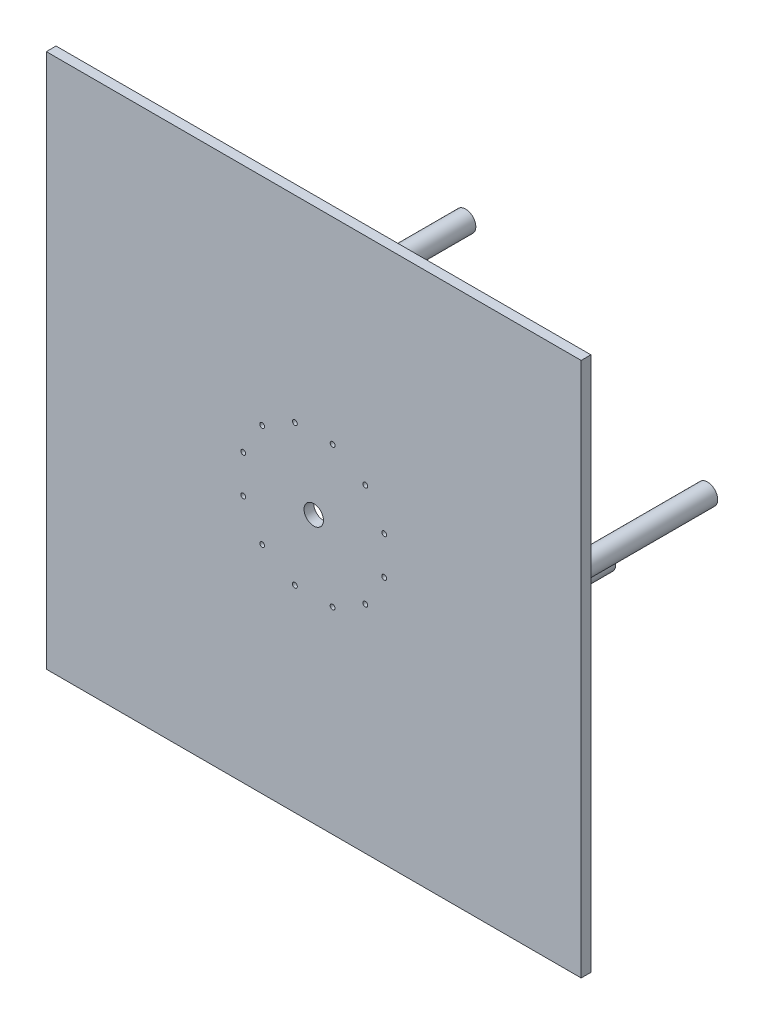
from build123d import *

# Parameters (mm, degrees)
ESQUISSE1_W                  = 1100
ESQUISSE1_H                  = 1100
BASE_EXTRUSION_DEPTH         = 20
ESQUISSE2_R                  = 21
ESQUISSE2_R_2                = 19
BOSS_EXTRU_1_DEPTH           = 300
ESQUISSE3_R                  = 20
ENL_V_MAT_EXTRU_1_DEPTH      = 1585.297951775
ESQUISSE5_R                  = 5
ENL_V_MAT_EXTRU_2_DEPTH      = 1585.297951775
R_P_TITION_CIRCULAIRE1_COUNT = 12
ESQUISSE6_R                  = 21
ESQUISSE6_R_2                = 19
BOSS_EXTRU_2_DEPTH           = 500
ESQUISSE7_R                  = 21
ESQUISSE7_R_2                = 19
BOSS_EXTRU_3_DEPTH           = 500
ESQUISSE8_R                  = 21
ESQUISSE8_R_2                = 19
BOSS_EXTRU_4_DEPTH           = 370


with BuildPart() as part:
    # Esquisse1 → Base-Extrusion (new body)
    with BuildSketch(Plane.XY):
        with Locations((550, 550)):
            Rectangle(ESQUISSE1_W, ESQUISSE1_H)
    extrude(amount=BASE_EXTRUSION_DEPTH)

    # Esquisse2 → Boss.-Extru.1 (add)
    with BuildSketch(Plane(origin=(0, 0, 0), x_dir=(-1, 0, 0), z_dir=(0, 0, -1))):
        with Locations((-268.092213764, 652.606042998)):
            Circle(ESQUISSE2_R)
        with Locations((-268.092213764, 652.606042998)):
            Circle(ESQUISSE2_R_2, mode=Mode.SUBTRACT)
    extrude(amount=BOSS_EXTRU_1_DEPTH)

    # Esquisse3 → Enl_v. mat.-Extru.1 (cut, through all)
    with BuildSketch(Plane(origin=(0, 0, 0), x_dir=(-1, 0, 0), z_dir=(0, 0, -1))):
        with Locations((-550, 550)):
            Circle(ESQUISSE3_R)
    extrude(amount=-ENL_V_MAT_EXTRU_1_DEPTH, mode=Mode.SUBTRACT)

    # Esquisse5 → Enl_v. mat.-Extru.2 (cut, through all)
    with BuildSketch(Plane(origin=(0, 0, 0), x_dir=(-1, 0, 0), z_dir=(0, 0, -1))):
        with Locations((-694.888873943, 588.822856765)):
            Circle(ESQUISSE5_R)
    enl_v_mat_extru_2 = extrude(amount=-ENL_V_MAT_EXTRU_2_DEPTH, mode=Mode.SUBTRACT)

    # R_p_tition circulaire1: Enl_v. mat.-Extru.2 ×12 about axis
    r_p_tition_circulaire1_axis = Axis((550, 550, 0), (0, 0, -1))
    for i in range(1, R_P_TITION_CIRCULAIRE1_COUNT):
        add(enl_v_mat_extru_2.rotate(r_p_tition_circulaire1_axis, i * 360 / R_P_TITION_CIRCULAIRE1_COUNT), mode=Mode.SUBTRACT)

    # Esquisse6 → Boss.-Extru.2 (add)
    with BuildSketch(Plane(origin=(0, 0, 0), x_dir=(-1, 0, 0), z_dir=(0, 0, -1))):
        with Locations((-839.777747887, 472.354286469)):
            Circle(ESQUISSE6_R)
        with Locations((-839.777747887, 472.354286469)):
            Circle(ESQUISSE6_R_2, mode=Mode.SUBTRACT)
    extrude(amount=BOSS_EXTRU_2_DEPTH)

    # Esquisse7 → Boss.-Extru.3 (add)
    with BuildSketch(Plane(origin=(0, 0, 0), x_dir=(-1, 0, 0), z_dir=(0, 0, -1))):
        with Locations((-629.975084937, 251.528919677)):
            Circle(ESQUISSE7_R)
        with Locations((-629.975084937, 251.528919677)):
            Circle(ESQUISSE7_R_2, mode=Mode.SUBTRACT)
    extrude(amount=BOSS_EXTRU_3_DEPTH)

    # Esquisse8 → Boss.-Extru.4 (add)
    with BuildSketch(Plane(origin=(0, 0, 0), x_dir=(-1, 0, 0), z_dir=(0, 0, -1))):
        with Locations((-472.354286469, 839.777747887)):
            Circle(ESQUISSE8_R)
        with Locations((-472.354286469, 839.777747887)):
            Circle(ESQUISSE8_R_2, mode=Mode.SUBTRACT)
    extrude(amount=BOSS_EXTRU_4_DEPTH)


solid = part.part
